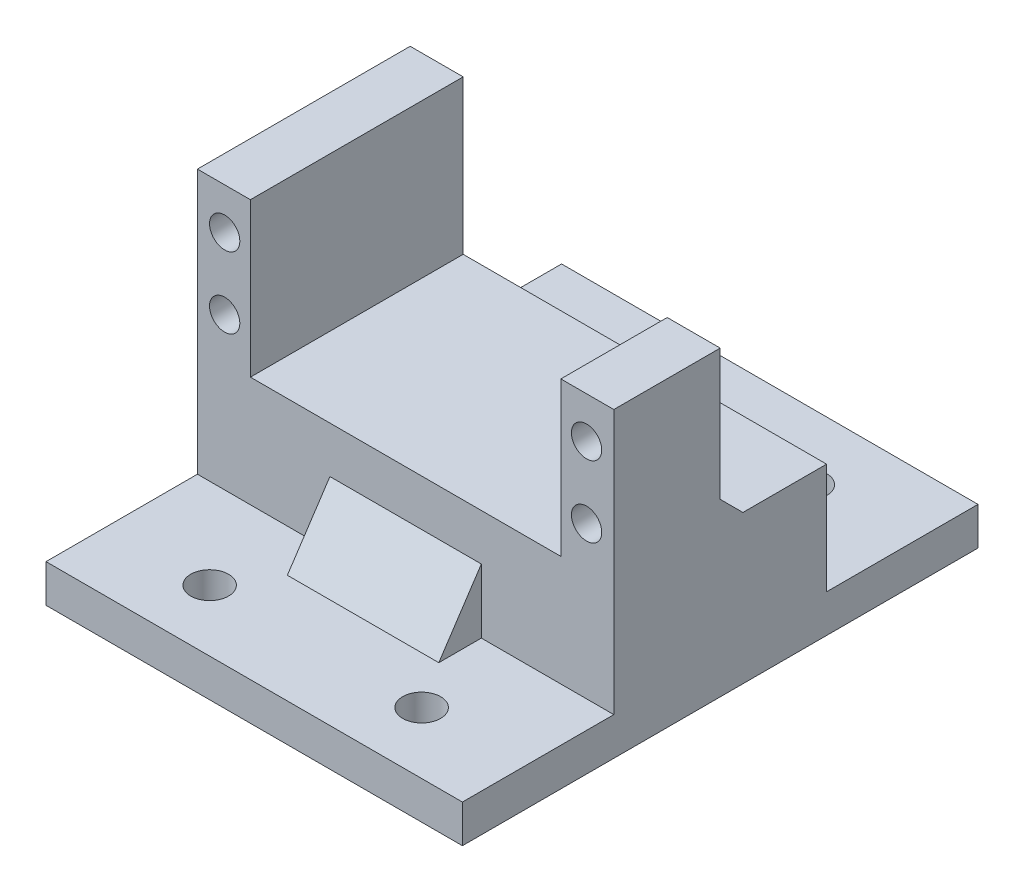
from build123d import *

# Parameters (mm, degrees)
SKETCH_1_W           = 55
SKETCH_1_H           = 28.1
EXTRUDE_1_DEPTH      = 39.9
CUT_EXTRUDE_1_DEPTH  = 20.3
SKETCH_3_R           = 2
CUT_EXTRUDE_2_DEPTH  = 38
SKETCH_6_W           = 36.833030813
SKETCH_6_H           = 2.888101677
CUT_EXTRUDE_3_DEPTH  = 1
EXTRUDE_2_REACH      = 71.774
SKETCH_9_R           = 2.5
CUT_EXTRUDE_5_DEPTH  = 44
SKETCH_10_R          = 2.5
CUT_EXTRUDE_6_DEPTH  = 44
SKETCH_11_R          = 4
CUT_EXTRUDE_10_DEPTH = 33
CUT_EXTRUDE_11_DEPTH = 74
SKETCH_13_W          = 20
SKETCH_13_H          = 5
EXTRUDE_3_DEPTH      = 55
SKETCH_14_R          = 2.5
CUT_EXTRUDE_12_DEPTH = 74
RIB_3_REACH          = 62.282
SKETCH_16_WALL_W     = 132.734179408
SKETCH_16_WALL_H     = 20
RIB_4_REACH          = 62.282
SKETCH_17_WALL_W     = 132.73651045
SKETCH_17_WALL_H     = 20
CUT_EXTRUDE_13_REACH = 66.69
CHAMFER_1_SIZE       = 3


with BuildPart() as part:
    # Sketch 1 → Extrude 1 (new body)
    with BuildSketch(Plane(origin=(0, 0, 0), x_dir=(1, 0, 0), z_dir=(0, 1, 0))):
        with Locations((8.653846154, -1.806410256)):
            Rectangle(SKETCH_1_W, SKETCH_1_H)
    extrude(amount=EXTRUDE_1_DEPTH)

    # Sketch 2 → Cut-Extrude 1 (cut)
    with BuildSketch(Plane(origin=(0, 39.9, 0), x_dir=(1, 0, 0), z_dir=(0, 1, 0))):
        Polygon((8.653846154, 12.243589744), (-11.846153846, 12.243589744), (-11.846153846, -15.856410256), (29.153846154, -15.856410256), (29.153846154, 12.243589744), align=None)
    extrude(amount=-CUT_EXTRUDE_1_DEPTH, mode=Mode.SUBTRACT)

    # Sketch 3 → Cut-Extrude 2 (cut)
    with BuildSketch(Plane.XY.offset(15.856410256)):
        with Locations((-15.246153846, 34.45)):
            Circle(SKETCH_3_R)
        with Locations((-15.246153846, 25.05)):
            Circle(SKETCH_3_R)
        with Locations((32.553846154, 34.45)):
            Circle(SKETCH_3_R)
        with Locations((32.553846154, 25.05)):
            Circle(SKETCH_3_R)
    extrude(amount=-CUT_EXTRUDE_2_DEPTH, mode=Mode.SUBTRACT)

    # Sketch 6 → Cut-Extrude 3 (cut)
    with BuildSketch(Plane(origin=(0, 0, -12.243589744), x_dir=(-1, 0, 0), z_dir=(0, 0, -1))):
        with Locations((-7.870676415, 1.444050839)):
            Rectangle(SKETCH_6_W, SKETCH_6_H)
    extrude(amount=-CUT_EXTRUDE_3_DEPTH, mode=Mode.SUBTRACT)

    # Extrude 2: up to this face of the body (flat: up to its plane)
    extrude_2_end = Plane(part.part.faces().sort_by_distance((36.153846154, 19.95, 1.806410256))[0])
    # Sketch 7 → Extrude 2 (add, up to the picked face)
    with BuildSketch(Plane.ZY.offset(18.846153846), mode=Mode.PRIVATE) as extrude_2_sk1:
        Polygon((-12.243589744, 19.95), (-47.743424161, 0), (-12.243589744, 0), align=None)
    extrude_2_tool1 = split(extrude(extrude_2_sk1.sketch, amount=-EXTRUDE_2_REACH, mode=Mode.PRIVATE), bisect_by=extrude_2_end, keep=Keep.BOTH, mode=Mode.PRIVATE)
    # Sketch 7 → Extrude 2 (add, up to the picked face)
    with BuildSketch(Plane.ZY.offset(18.846153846), mode=Mode.PRIVATE) as extrude_2_sk2:
        Polygon((15.856410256, 19.95), (15.856410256, 0), (41.316524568, 0), align=None)
    extrude_2_tool2 = split(extrude(extrude_2_sk2.sketch, amount=-EXTRUDE_2_REACH, mode=Mode.PRIVATE), bisect_by=extrude_2_end, keep=Keep.BOTH, mode=Mode.PRIVATE)
    add(extrude_2_tool1.solids().sort_by(Axis((-18.846154, 6.65, -24.076868), (1, 0, 0)))[0])
    add(extrude_2_tool2.solids().sort_by(Axis((-18.846154, 6.65, 24.343115), (1, 0, 0)))[0])

    # Sketch 9 → Cut-Extrude 5 (cut)
    with BuildSketch(Plane.XZ):
        with Locations(Location((-6.846153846, -29.80491201, 0), (0, 0, 270))):
            Circle(SKETCH_9_R)
        with Locations(Location((24.153846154, -29.743424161, 0), (0, 0, 270))):
            Circle(SKETCH_9_R)
    extrude(amount=-CUT_EXTRUDE_5_DEPTH, mode=Mode.SUBTRACT)

    # Sketch 10 → Cut-Extrude 6 (cut)
    with BuildSketch(Plane.XZ):
        with Locations(Location((-6.846153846, 30.009624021, 0), (0, 0, 270))):
            Circle(SKETCH_10_R)
        with Locations(Location((24.153846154, 30.009624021, 0), (0, 0, 270))):
            Circle(SKETCH_10_R)
    extrude(amount=-CUT_EXTRUDE_6_DEPTH, mode=Mode.SUBTRACT)

    # Sketch 11 → Cut-Extrude 10 (cut)
    with BuildSketch(Plane(origin=(0, 39.9, 0), x_dir=(1, 0, 0), z_dir=(0, 1, 0))):
        with Locations(Location((24.153846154, 29.743424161, 0), (0, 0, 270))):
            Circle(SKETCH_11_R)
        with Locations(Location((-6.846153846, 29.80491201, 0), (0, 0, 270))):
            Circle(SKETCH_11_R)
        with Locations((-6.846153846, -30.009624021)):
            Circle(SKETCH_11_R)
        with Locations((24.153846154, -30.009624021)):
            Circle(SKETCH_11_R)
    extrude(amount=-CUT_EXTRUDE_10_DEPTH, mode=Mode.SUBTRACT)

    # Sketch 12 → Cut-Extrude 11 (cut)
    with BuildSketch(Plane(origin=(36.153846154, 0, 0), x_dir=(0, 0, -1), z_dir=(1, 0, 0))):
        Polygon((-15.856410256, 19.95), (-15.856410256, 0), (-53.925705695, 0), align=None)
        Polygon((12.243589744, 19.95), (12.243589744, 0), (49.085729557, 0), align=None)
    extrude(amount=-CUT_EXTRUDE_11_DEPTH, mode=Mode.SUBTRACT)

    # Sketch 13 → Extrude 3 (add)
    with BuildSketch(Plane(origin=(36.153846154, 0, 0), x_dir=(0, 0, -1), z_dir=(1, 0, 0))):
        with Locations((-25.856410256, 2.5)):
            Rectangle(SKETCH_13_W, SKETCH_13_H)
        with Locations((22.243589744, 2.5)):
            Rectangle(SKETCH_13_W, SKETCH_13_H)
    extrude(amount=-EXTRUDE_3_DEPTH)

    # Sketch 14 → Cut-Extrude 12 (cut)
    with BuildSketch(Plane(origin=(0, 5, 0), x_dir=(1, 0, 0), z_dir=(0, 1, 0))):
        with Locations(Location((-5.346153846, 23.264164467, 0), (0, 0, 270))):
            Circle(SKETCH_14_R)
        with Locations(Location((22.653846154, 23.264164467, 0), (0, 0, 270))):
            Circle(SKETCH_14_R)
        with Locations(Location((-5.346153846, -27.740984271, 0), (0, 0, 270))):
            Circle(SKETCH_14_R)
        with Locations(Location((22.653846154, -27.740984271, 0), (0, 0, 270))):
            Circle(SKETCH_14_R)
    extrude(amount=-CUT_EXTRUDE_12_DEPTH, mode=Mode.SUBTRACT)

    # Sketch 16 wall → Rib 3 (add, up to next)
    with BuildSketch(Plane(origin=(8.653846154, 9.239337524, -15.051479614), x_dir=(0, -0.833710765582, -0.552201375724), z_dir=(0, -0.552201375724, 0.833710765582)), mode=Mode.PRIVATE) as rib_3_sk1:
        Rectangle(SKETCH_16_WALL_W, SKETCH_16_WALL_H)
    rib_3_tool1 = extrude(rib_3_sk1.sketch, amount=RIB_3_REACH, mode=Mode.PRIVATE) - part.part
    add(rib_3_tool1.solids().sort_by_distance((8.653846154, 9.239337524, -15.051479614))[0])

    # Sketch 17 wall → Rib 4 (add, up to next)
    with BuildSketch(Plane(origin=(8.653846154, 9.239337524, 18.666410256), x_dir=(0, -0.833519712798, 0.552489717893), z_dir=(0, 0.552489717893, 0.833519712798)), mode=Mode.PRIVATE) as rib_4_sk1:
        Rectangle(SKETCH_17_WALL_W, SKETCH_17_WALL_H)
    rib_4_tool1 = extrude(rib_4_sk1.sketch, amount=-RIB_4_REACH, mode=Mode.PRIVATE) - part.part
    add(rib_4_tool1.solids().sort_by_distance((8.653846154, 9.239337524, 18.666410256))[0])

    # Cut-Extrude 13: up to this face of the body (flat: up to its plane)
    cut_extrude_13_end = Plane(part.part.faces().sort_by_distance((8.653846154, 19.6, 1.806410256))[0])
    # Sketch 18 → Cut-Extrude 13 (cut, up to the picked face)
    with BuildSketch(Plane(origin=(0, 39.9, 0), x_dir=(1, 0, 0), z_dir=(0, 1, 0)), mode=Mode.PRIVATE) as cut_extrude_13_sk1:
        Polygon((29.153846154, 12.243589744), (29.153846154, 2.243589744), (29.153846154, -1.806410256), (36.153846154, -1.806410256), (36.153846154, 2.243589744), (36.153846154, 12.243589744), align=None)
    cut_extrude_13_tool1 = split(extrude(cut_extrude_13_sk1.sketch, amount=-CUT_EXTRUDE_13_REACH, mode=Mode.PRIVATE), bisect_by=cut_extrude_13_end, keep=Keep.BOTH, mode=Mode.PRIVATE)
    add(cut_extrude_13_tool1.solids().sort_by(Axis((32.653846, 39.9, -5.21859), (0, -1, 0)))[0], mode=Mode.SUBTRACT)

    # Chamfer 1
    chamfer_1_edges = [part.edges().sort_by_distance(p)[0] for p in [
        (32.653846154, 19.6, 1.806410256),
    ]]
    chamfer(chamfer_1_edges, length=CHAMFER_1_SIZE)


solid = part.part
